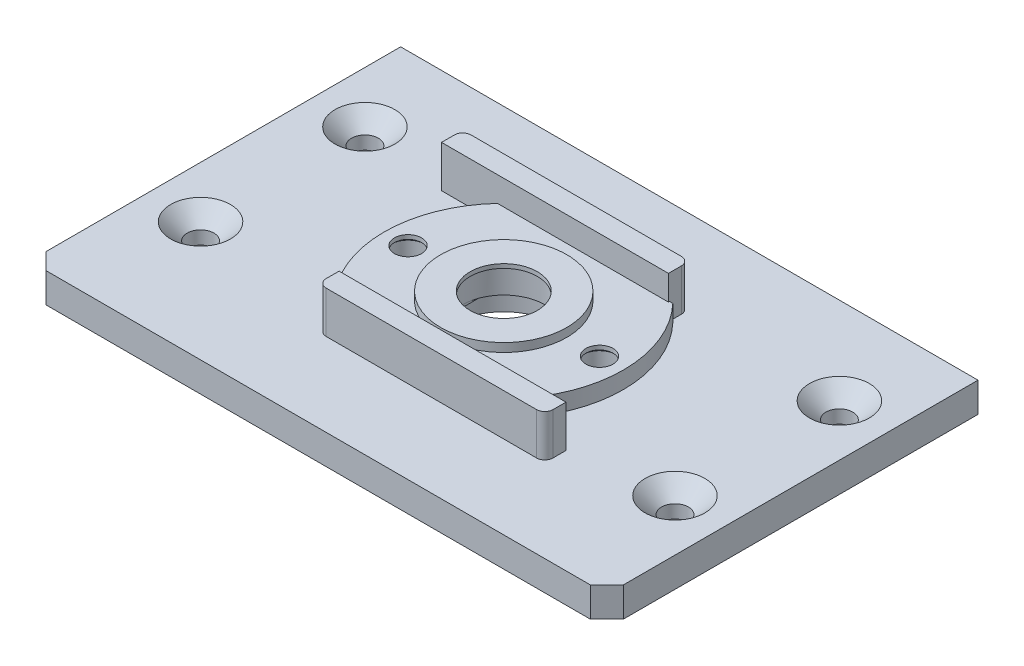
ISO-10303-21;
HEADER;
FILE_DESCRIPTION(('STEP AP214'),'2;1');
FILE_NAME('part.step','',(''),(''),'','','');
FILE_SCHEMA(('AUTOMOTIVE_DESIGN { 1 0 10303 214 1 1 1 1 }'));
ENDSEC;
DATA;
#1=APPLICATION_CONTEXT('core data for automotive mechanical design processes');
#2=APPLICATION_PROTOCOL_DEFINITION('international standard','automotive_design',2000,#1);
#3=PRODUCT_CONTEXT('',#1,'mechanical');
#4=PRODUCT('Part','Part','',(#3));
#5=PRODUCT_RELATED_PRODUCT_CATEGORY('part','',(#4));
#6=PRODUCT_DEFINITION_FORMATION('','',#4);
#7=PRODUCT_DEFINITION_CONTEXT('part definition',#1,'design');
#8=PRODUCT_DEFINITION('design','',#6,#7);
#9=PRODUCT_DEFINITION_SHAPE('','',#8);
#10=(LENGTH_UNIT() NAMED_UNIT(*) SI_UNIT(.MILLI.,.METRE.));
#11=(NAMED_UNIT(*) PLANE_ANGLE_UNIT() SI_UNIT($,.RADIAN.));
#12=(NAMED_UNIT(*) SI_UNIT($,.STERADIAN.) SOLID_ANGLE_UNIT());
#13=UNCERTAINTY_MEASURE_WITH_UNIT(LENGTH_MEASURE(1.E-05),#10,'distance_accuracy_value','');
#14=(GEOMETRIC_REPRESENTATION_CONTEXT(3) GLOBAL_UNCERTAINTY_ASSIGNED_CONTEXT((#13)) GLOBAL_UNIT_ASSIGNED_CONTEXT((#10,
#11,#12)) REPRESENTATION_CONTEXT('',''));
#15=CARTESIAN_POINT('',(0.,0.,0.));
#16=DIRECTION('',(0.,0.,1.));
#17=DIRECTION('',(1.,0.,0.));
#18=AXIS2_PLACEMENT_3D('',#15,#16,#17);
#19=CARTESIAN_POINT('',(0.,-3.6,0.));
#20=DIRECTION('',(0.,1.,0.));
#21=DIRECTION('',(0.,0.,1.));
#22=AXIS2_PLACEMENT_3D('',#19,#20,#21);
#23=CYLINDRICAL_SURFACE('',#22,5.075);
#24=CARTESIAN_POINT('',(0.,2.603,0.));
#25=DIRECTION('',(0.,1.,0.));
#26=DIRECTION('',(0.,0.,1.));
#27=AXIS2_PLACEMENT_3D('',#24,#25,#26);
#28=CIRCLE('',#27,5.075);
#29=CARTESIAN_POINT('',(0.,2.603,5.07499999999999));
#30=VERTEX_POINT('',#29);
#31=EDGE_CURVE('E653',#30,#30,#28,.F.);
#32=ORIENTED_EDGE('',*,*,#31,.F.);
#33=EDGE_LOOP('',(#32));
#34=FACE_BOUND('',#33,.T.);
#35=CARTESIAN_POINT('',(0.,-0.900000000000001,0.));
#36=DIRECTION('',(0.,-1.,0.));
#37=DIRECTION('',(0.,0.,-1.));
#38=AXIS2_PLACEMENT_3D('',#35,#36,#37);
#39=CIRCLE('',#38,5.075);
#40=CARTESIAN_POINT('',(5.07499999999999,-0.900000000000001,0.));
#41=VERTEX_POINT('',#40);
#42=CARTESIAN_POINT('',(-5.07500000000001,-0.900000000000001,0.));
#43=VERTEX_POINT('',#42);
#44=EDGE_CURVE('E324',#41,#43,#39,.T.);
#45=ORIENTED_EDGE('',*,*,#44,.T.);
#46=CARTESIAN_POINT('',(0.,-0.900000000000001,0.));
#47=DIRECTION('',(0.,-1.,0.));
#48=DIRECTION('',(0.,0.,-1.));
#49=AXIS2_PLACEMENT_3D('',#46,#47,#48);
#50=CIRCLE('',#49,5.075);
#51=EDGE_CURVE('E330',#43,#41,#50,.T.);
#52=ORIENTED_EDGE('',*,*,#51,.T.);
#53=EDGE_LOOP('',(#45,#52));
#54=FACE_BOUND('',#53,.T.);
#55=ADVANCED_FACE('F53',(#34,#54),#23,.F.);
#56=CARTESIAN_POINT('',(0.,-1.2,0.));
#57=DIRECTION('',(0.,-1.,0.));
#58=DIRECTION('',(0.,0.,-1.));
#59=AXIS2_PLACEMENT_3D('',#56,#57,#58);
#60=PLANE('',#59);
#61=CARTESIAN_POINT('',(0.,-1.2,0.));
#62=DIRECTION('',(0.,-1.,0.));
#63=DIRECTION('',(0.,0.,-1.));
#64=AXIS2_PLACEMENT_3D('',#61,#62,#63);
#65=CIRCLE('',#64,6.404);
#66=CARTESIAN_POINT('',(5.07499999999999,-1.2000000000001,-3.90584062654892));
#67=VERTEX_POINT('',#66);
#68=CARTESIAN_POINT('',(5.07499999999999,-1.2,3.9058406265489));
#69=VERTEX_POINT('',#68);
#70=EDGE_CURVE('E338',#67,#69,#65,.T.);
#71=ORIENTED_EDGE('',*,*,#70,.T.);
#72=DIRECTION('',(0.,0.,-1.));
#73=VECTOR('',#72,1.);
#74=CARTESIAN_POINT('',(5.07499999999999,-1.2,0.));
#75=LINE('',#74,#73);
#76=EDGE_CURVE('E12',#69,#67,#75,.T.);
#77=ORIENTED_EDGE('',*,*,#76,.T.);
#78=EDGE_LOOP('',(#71,#77));
#79=FACE_BOUND('',#78,.T.);
#80=ADVANCED_FACE('F676',(#79),#60,.T.);
#81=CARTESIAN_POINT('',(-11.608,2.06,0.));
#82=DIRECTION('',(0.,-1.,0.));
#83=DIRECTION('',(0.,0.,-1.));
#84=AXIS2_PLACEMENT_3D('',#81,#82,#83);
#85=CYLINDRICAL_SURFACE('',#84,2.1);
#86=CARTESIAN_POINT('',(-11.608,1.15999999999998,0.));
#87=DIRECTION('',(0.,1.,0.));
#88=DIRECTION('',(0.,0.,1.));
#89=AXIS2_PLACEMENT_3D('',#86,#87,#88);
#90=CIRCLE('',#89,2.1);
#91=CARTESIAN_POINT('',(-11.608,1.15999999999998,2.1));
#92=VERTEX_POINT('',#91);
#93=EDGE_CURVE('E289',#92,#92,#90,.T.);
#94=ORIENTED_EDGE('',*,*,#93,.T.);
#95=EDGE_LOOP('',(#94));
#96=FACE_BOUND('',#95,.T.);
#97=CARTESIAN_POINT('',(-11.608,-3.6,0.));
#98=DIRECTION('',(0.,-1.,0.));
#99=DIRECTION('',(0.,0.,-1.));
#100=AXIS2_PLACEMENT_3D('',#97,#98,#99);
#101=CIRCLE('',#100,2.1);
#102=CARTESIAN_POINT('',(-11.608,-3.6,-2.1));
#103=VERTEX_POINT('',#102);
#104=EDGE_CURVE('E387',#103,#103,#101,.F.);
#105=ORIENTED_EDGE('',*,*,#104,.F.);
#106=EDGE_LOOP('',(#105));
#107=FACE_BOUND('',#106,.T.);
#108=ADVANCED_FACE('F682',(#96,#107),#85,.F.);
#109=CARTESIAN_POINT('',(11.608,2.06,0.));
#110=DIRECTION('',(0.,-1.,0.));
#111=DIRECTION('',(0.,0.,-1.));
#112=AXIS2_PLACEMENT_3D('',#109,#110,#111);
#113=CYLINDRICAL_SURFACE('',#112,2.1);
#114=CARTESIAN_POINT('',(11.608,1.16,0.));
#115=DIRECTION('',(0.,1.,0.));
#116=DIRECTION('',(0.,0.,1.));
#117=AXIS2_PLACEMENT_3D('',#114,#115,#116);
#118=CIRCLE('',#117,2.1);
#119=CARTESIAN_POINT('',(11.608,1.16,2.1));
#120=VERTEX_POINT('',#119);
#121=EDGE_CURVE('E601',#120,#120,#118,.T.);
#122=ORIENTED_EDGE('',*,*,#121,.T.);
#123=EDGE_LOOP('',(#122));
#124=FACE_BOUND('',#123,.T.);
#125=CARTESIAN_POINT('',(11.608,-3.6,0.));
#126=DIRECTION('',(0.,-1.,0.));
#127=DIRECTION('',(0.,0.,-1.));
#128=AXIS2_PLACEMENT_3D('',#125,#126,#127);
#129=CIRCLE('',#128,2.1);
#130=CARTESIAN_POINT('',(11.608,-3.6,-2.1));
#131=VERTEX_POINT('',#130);
#132=EDGE_CURVE('E391',#131,#131,#129,.F.);
#133=ORIENTED_EDGE('',*,*,#132,.F.);
#134=EDGE_LOOP('',(#133));
#135=FACE_BOUND('',#134,.T.);
#136=ADVANCED_FACE('F745',(#124,#135),#113,.F.);
#137=CARTESIAN_POINT('',(0.,-3.6,0.));
#138=DIRECTION('',(0.,1.,0.));
#139=DIRECTION('',(0.,0.,1.));
#140=AXIS2_PLACEMENT_3D('',#137,#138,#139);
#141=CYLINDRICAL_SURFACE('',#140,6.404);
#142=DIRECTION('',(0.,1.,0.));
#143=VECTOR('',#142,1.);
#144=CARTESIAN_POINT('',(5.07499999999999,-3.6000000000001,-3.90584062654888));
#145=LINE('',#144,#143);
#146=CARTESIAN_POINT('',(5.07499999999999,-0.900000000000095,-3.90584062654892));
#147=VERTEX_POINT('',#146);
#148=EDGE_CURVE('E73',#67,#147,#145,.T.);
#149=ORIENTED_EDGE('',*,*,#148,.T.);
#150=CARTESIAN_POINT('',(0.,-0.899999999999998,0.));
#151=DIRECTION('',(0.,-1.,0.));
#152=DIRECTION('',(0.,0.,-1.));
#153=AXIS2_PLACEMENT_3D('',#150,#151,#152);
#154=CIRCLE('',#153,6.404);
#155=CARTESIAN_POINT('',(-5.07500000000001,-0.900000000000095,-3.90584062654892));
#156=VERTEX_POINT('',#155);
#157=EDGE_CURVE('E290',#156,#147,#154,.T.);
#158=ORIENTED_EDGE('',*,*,#157,.F.);
#159=DIRECTION('',(0.,1.,0.));
#160=VECTOR('',#159,1.);
#161=CARTESIAN_POINT('',(-5.07500000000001,-3.6000000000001,-3.90584062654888));
#162=LINE('',#161,#160);
#163=CARTESIAN_POINT('',(-5.07500000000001,-1.2000000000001,-3.90584062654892));
#164=VERTEX_POINT('',#163);
#165=EDGE_CURVE('E83',#164,#156,#162,.T.);
#166=ORIENTED_EDGE('',*,*,#165,.F.);
#167=CARTESIAN_POINT('',(0.,-1.2,0.));
#168=DIRECTION('',(0.,-1.,0.));
#169=DIRECTION('',(0.,0.,-1.));
#170=AXIS2_PLACEMENT_3D('',#167,#168,#169);
#171=CIRCLE('',#170,6.404);
#172=CARTESIAN_POINT('',(-5.07500000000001,-1.2,3.9058406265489));
#173=VERTEX_POINT('',#172);
#174=EDGE_CURVE('E297',#173,#164,#171,.T.);
#175=ORIENTED_EDGE('',*,*,#174,.F.);
#176=DIRECTION('',(0.,1.,0.));
#177=VECTOR('',#176,1.);
#178=CARTESIAN_POINT('',(-5.07500000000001,-3.6,3.9058406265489));
#179=LINE('',#178,#177);
#180=CARTESIAN_POINT('',(-5.07500000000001,-0.900000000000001,3.9058406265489));
#181=VERTEX_POINT('',#180);
#182=EDGE_CURVE('E293',#173,#181,#179,.T.);
#183=ORIENTED_EDGE('',*,*,#182,.T.);
#184=CARTESIAN_POINT('',(5.07499999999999,-0.900000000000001,3.9058406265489));
#185=VERTEX_POINT('',#184);
#186=EDGE_CURVE('E277',#185,#181,#154,.T.);
#187=ORIENTED_EDGE('',*,*,#186,.F.);
#188=DIRECTION('',(0.,1.,0.));
#189=VECTOR('',#188,1.);
#190=CARTESIAN_POINT('',(5.07499999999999,-3.6,3.9058406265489));
#191=LINE('',#190,#189);
#192=EDGE_CURVE('E314',#69,#185,#191,.T.);
#193=ORIENTED_EDGE('',*,*,#192,.F.);
#194=ORIENTED_EDGE('',*,*,#70,.F.);
#195=EDGE_LOOP('',(#149,#158,#166,#175,#183,#187,#193,#194));
#196=FACE_BOUND('',#195,.T.);
#197=CARTESIAN_POINT('',(0.,-3.6,0.));
#198=DIRECTION('',(0.,-1.,0.));
#199=DIRECTION('',(0.,0.,-1.));
#200=AXIS2_PLACEMENT_3D('',#197,#198,#199);
#201=CIRCLE('',#200,6.404);
#202=CARTESIAN_POINT('',(0.,-3.6,-6.40400000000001));
#203=VERTEX_POINT('',#202);
#204=EDGE_CURVE('E383',#203,#203,#201,.T.);
#205=ORIENTED_EDGE('',*,*,#204,.T.);
#206=EDGE_LOOP('',(#205));
#207=FACE_BOUND('',#206,.T.);
#208=ADVANCED_FACE('F294',(#196,#207),#141,.F.);
#209=CARTESIAN_POINT('',(0.,-0.900000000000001,0.));
#210=DIRECTION('',(0.,-1.,0.));
#211=DIRECTION('',(0.,0.,-1.));
#212=AXIS2_PLACEMENT_3D('',#209,#210,#211);
#213=PLANE('',#212);
#214=ORIENTED_EDGE('',*,*,#51,.F.);
#215=DIRECTION('',(0.,0.,1.));
#216=VECTOR('',#215,1.);
#217=CARTESIAN_POINT('',(-5.07500000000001,-0.900000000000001,0.));
#218=LINE('',#217,#216);
#219=EDGE_CURVE('E304',#156,#43,#218,.T.);
#220=ORIENTED_EDGE('',*,*,#219,.F.);
#221=ORIENTED_EDGE('',*,*,#157,.T.);
#222=DIRECTION('',(0.,0.,1.));
#223=VECTOR('',#222,1.);
#224=CARTESIAN_POINT('',(5.07499999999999,-0.900000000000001,0.));
#225=LINE('',#224,#223);
#226=EDGE_CURVE('E310',#147,#41,#225,.T.);
#227=ORIENTED_EDGE('',*,*,#226,.T.);
#228=EDGE_LOOP('',(#214,#220,#221,#227));
#229=FACE_BOUND('',#228,.T.);
#230=ADVANCED_FACE('F1139',(#229),#213,.T.);
#231=ORIENTED_EDGE('',*,*,#44,.F.);
#232=EDGE_CURVE('E285',#41,#185,#225,.T.);
#233=ORIENTED_EDGE('',*,*,#232,.T.);
#234=ORIENTED_EDGE('',*,*,#186,.T.);
#235=EDGE_CURVE('E282',#43,#181,#218,.T.);
#236=ORIENTED_EDGE('',*,*,#235,.F.);
#237=EDGE_LOOP('',(#231,#233,#234,#236));
#238=FACE_BOUND('',#237,.T.);
#239=ADVANCED_FACE('F280',(#238),#213,.T.);
#240=CARTESIAN_POINT('',(0.,2.06,0.));
#241=DIRECTION('',(0.,-1.,0.));
#242=DIRECTION('',(0.,0.,-1.));
#243=AXIS2_PLACEMENT_3D('',#240,#241,#242);
#244=CYLINDRICAL_SURFACE('',#243,14.5);
#245=DIRECTION('',(0.,-1.,0.));
#246=VECTOR('',#245,1.);
#247=CARTESIAN_POINT('',(10.6260079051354,2.06,9.866));
#248=LINE('',#247,#246);
#249=CARTESIAN_POINT('',(10.6260079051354,0.,9.866));
#250=VERTEX_POINT('',#249);
#251=CARTESIAN_POINT('',(10.6260079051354,2.06,9.866));
#252=VERTEX_POINT('',#251);
#253=EDGE_CURVE('E483',#250,#252,#248,.F.);
#254=ORIENTED_EDGE('',*,*,#253,.F.);
#255=CARTESIAN_POINT('',(0.,0.,0.));
#256=DIRECTION('',(0.,1.,0.));
#257=DIRECTION('',(0.,0.,1.));
#258=AXIS2_PLACEMENT_3D('',#255,#256,#257);
#259=CIRCLE('',#258,14.5);
#260=CARTESIAN_POINT('',(10.5,0.,-10.));
#261=VERTEX_POINT('',#260);
#262=EDGE_CURVE('E514',#250,#261,#259,.T.);
#263=ORIENTED_EDGE('',*,*,#262,.T.);
#264=DIRECTION('',(0.,-1.,0.));
#265=VECTOR('',#264,1.);
#266=CARTESIAN_POINT('',(10.5,2.05999999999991,-10.));
#267=LINE('',#266,#265);
#268=CARTESIAN_POINT('',(10.5,2.05999999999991,-10.));
#269=VERTEX_POINT('',#268);
#270=EDGE_CURVE('E523',#269,#261,#267,.T.);
#271=ORIENTED_EDGE('',*,*,#270,.F.);
#272=CARTESIAN_POINT('',(0.,2.06,0.));
#273=DIRECTION('',(0.,1.,0.));
#274=DIRECTION('',(0.,0.,1.));
#275=AXIS2_PLACEMENT_3D('',#272,#273,#274);
#276=CIRCLE('',#275,14.5);
#277=EDGE_CURVE('E503',#252,#269,#276,.T.);
#278=ORIENTED_EDGE('',*,*,#277,.F.);
#279=EDGE_LOOP('',(#254,#263,#271,#278));
#280=FACE_BOUND('',#279,.T.);
#281=ADVANCED_FACE('F723',(#280),#244,.T.);
#282=DIRECTION('',(0.,-1.,0.));
#283=VECTOR('',#282,1.);
#284=CARTESIAN_POINT('',(-10.6260079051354,2.05999999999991,-9.866));
#285=LINE('',#284,#283);
#286=CARTESIAN_POINT('',(-10.6260079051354,0.,-9.866));
#287=VERTEX_POINT('',#286);
#288=CARTESIAN_POINT('',(-10.6260079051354,2.05999999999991,-9.866));
#289=VERTEX_POINT('',#288);
#290=EDGE_CURVE('E490',#287,#289,#285,.F.);
#291=ORIENTED_EDGE('',*,*,#290,.F.);
#292=CARTESIAN_POINT('',(-10.5,0.,10.));
#293=VERTEX_POINT('',#292);
#294=EDGE_CURVE('E500',#287,#293,#259,.T.);
#295=ORIENTED_EDGE('',*,*,#294,.T.);
#296=DIRECTION('',(0.,-1.,0.));
#297=VECTOR('',#296,1.);
#298=CARTESIAN_POINT('',(-10.5,2.06,10.));
#299=LINE('',#298,#297);
#300=CARTESIAN_POINT('',(-10.5,2.06,10.));
#301=VERTEX_POINT('',#300);
#302=EDGE_CURVE('E507',#301,#293,#299,.T.);
#303=ORIENTED_EDGE('',*,*,#302,.F.);
#304=EDGE_CURVE('E504',#289,#301,#276,.T.);
#305=ORIENTED_EDGE('',*,*,#304,.F.);
#306=EDGE_LOOP('',(#291,#295,#303,#305));
#307=FACE_BOUND('',#306,.T.);
#308=ADVANCED_FACE('F711',(#307),#244,.T.);
#309=CARTESIAN_POINT('',(0.,2.06,0.));
#310=DIRECTION('',(0.,1.,0.));
#311=DIRECTION('',(0.,0.,1.));
#312=AXIS2_PLACEMENT_3D('',#309,#310,#311);
#313=PLANE('',#312);
#314=CARTESIAN_POINT('',(0.,2.06,0.));
#315=DIRECTION('',(0.,1.,0.));
#316=DIRECTION('',(0.,0.,1.));
#317=AXIS2_PLACEMENT_3D('',#314,#315,#316);
#318=CIRCLE('',#317,7.65);
#319=CARTESIAN_POINT('',(0.,2.06,7.64999999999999));
#320=VERTEX_POINT('',#319);
#321=EDGE_CURVE('E495',#320,#320,#318,.T.);
#322=ORIENTED_EDGE('',*,*,#321,.F.);
#323=EDGE_LOOP('',(#322));
#324=FACE_BOUND('',#323,.T.);
#325=DIRECTION('',(0.,0.,-1.));
#326=VECTOR('',#325,1.);
#327=CARTESIAN_POINT('',(10.099911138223,2.06,0.));
#328=LINE('',#327,#326);
#329=CARTESIAN_POINT('',(10.099911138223,2.05999999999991,-9.866));
#330=VERTEX_POINT('',#329);
#331=CARTESIAN_POINT('',(10.099911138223,2.05999999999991,-10.));
#332=VERTEX_POINT('',#331);
#333=EDGE_CURVE('E538',#330,#332,#328,.T.);
#334=ORIENTED_EDGE('',*,*,#333,.F.);
#335=DIRECTION('',(-1.,0.,0.));
#336=VECTOR('',#335,1.);
#337=CARTESIAN_POINT('',(0.,2.05999999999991,-9.866));
#338=LINE('',#337,#336);
#339=EDGE_CURVE('E542',#330,#289,#338,.T.);
#340=ORIENTED_EDGE('',*,*,#339,.T.);
#341=ORIENTED_EDGE('',*,*,#304,.T.);
#342=DIRECTION('',(1.,0.,0.));
#343=VECTOR('',#342,1.);
#344=CARTESIAN_POINT('',(0.,2.06,10.));
#345=LINE('',#344,#343);
#346=CARTESIAN_POINT('',(-10.099911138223,2.06,10.));
#347=VERTEX_POINT('',#346);
#348=EDGE_CURVE('E499',#301,#347,#345,.T.);
#349=ORIENTED_EDGE('',*,*,#348,.T.);
#350=DIRECTION('',(0.,0.,1.));
#351=VECTOR('',#350,1.);
#352=CARTESIAN_POINT('',(-10.099911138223,2.06,0.));
#353=LINE('',#352,#351);
#354=CARTESIAN_POINT('',(-10.099911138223,2.06,9.86599999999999));
#355=VERTEX_POINT('',#354);
#356=EDGE_CURVE('E531',#355,#347,#353,.T.);
#357=ORIENTED_EDGE('',*,*,#356,.F.);
#358=DIRECTION('',(1.,0.,0.));
#359=VECTOR('',#358,1.);
#360=CARTESIAN_POINT('',(0.,2.06,9.866));
#361=LINE('',#360,#359);
#362=EDGE_CURVE('E535',#355,#252,#361,.T.);
#363=ORIENTED_EDGE('',*,*,#362,.T.);
#364=ORIENTED_EDGE('',*,*,#277,.T.);
#365=DIRECTION('',(1.,0.,0.));
#366=VECTOR('',#365,1.);
#367=CARTESIAN_POINT('',(0.,2.05999999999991,-10.));
#368=LINE('',#367,#366);
#369=EDGE_CURVE('E508',#332,#269,#368,.T.);
#370=ORIENTED_EDGE('',*,*,#369,.F.);
#371=EDGE_LOOP('',(#334,#340,#341,#349,#357,#363,#364,#370));
#372=FACE_BOUND('',#371,.T.);
#373=CARTESIAN_POINT('',(11.608,2.06,0.));
#374=DIRECTION('',(0.,1.,0.));
#375=DIRECTION('',(0.,0.,1.));
#376=AXIS2_PLACEMENT_3D('',#373,#374,#375);
#377=CIRCLE('',#376,1.65);
#378=CARTESIAN_POINT('',(11.608,2.06,1.65));
#379=VERTEX_POINT('',#378);
#380=EDGE_CURVE('E343',#379,#379,#377,.T.);
#381=ORIENTED_EDGE('',*,*,#380,.F.);
#382=EDGE_LOOP('',(#381));
#383=FACE_BOUND('',#382,.T.);
#384=CARTESIAN_POINT('',(-11.608,2.06,0.));
#385=DIRECTION('',(0.,1.,0.));
#386=DIRECTION('',(0.,0.,1.));
#387=AXIS2_PLACEMENT_3D('',#384,#385,#386);
#388=CIRCLE('',#387,1.65);
#389=CARTESIAN_POINT('',(-11.608,2.06,1.65));
#390=VERTEX_POINT('',#389);
#391=EDGE_CURVE('E339',#390,#390,#388,.T.);
#392=ORIENTED_EDGE('',*,*,#391,.F.);
#393=EDGE_LOOP('',(#392));
#394=FACE_BOUND('',#393,.T.);
#395=ADVANCED_FACE('F707',(#324,#372,#383,#394),#313,.T.);
#396=CARTESIAN_POINT('',(0.,3.103,0.));
#397=DIRECTION('',(0.,-1.,0.));
#398=DIRECTION('',(0.,0.,-1.));
#399=AXIS2_PLACEMENT_3D('',#396,#397,#398);
#400=CYLINDRICAL_SURFACE('',#399,7.65);
#401=ORIENTED_EDGE('',*,*,#321,.T.);
#402=EDGE_LOOP('',(#401));
#403=FACE_BOUND('',#402,.T.);
#404=CARTESIAN_POINT('',(0.,3.103,0.));
#405=DIRECTION('',(0.,1.,0.));
#406=DIRECTION('',(0.,0.,1.));
#407=AXIS2_PLACEMENT_3D('',#404,#405,#406);
#408=CIRCLE('',#407,7.65);
#409=CARTESIAN_POINT('',(0.,3.103,7.64999999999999));
#410=VERTEX_POINT('',#409);
#411=EDGE_CURVE('E527',#410,#410,#408,.T.);
#412=ORIENTED_EDGE('',*,*,#411,.F.);
#413=EDGE_LOOP('',(#412));
#414=FACE_BOUND('',#413,.T.);
#415=ADVANCED_FACE('F710',(#403,#414),#400,.T.);
#416=CARTESIAN_POINT('',(0.,3.103,0.));
#417=DIRECTION('',(0.,1.,0.));
#418=DIRECTION('',(0.,0.,1.));
#419=AXIS2_PLACEMENT_3D('',#416,#417,#418);
#420=PLANE('',#419);
#421=ORIENTED_EDGE('',*,*,#411,.T.);
#422=EDGE_LOOP('',(#421));
#423=FACE_BOUND('',#422,.T.);
#424=CARTESIAN_POINT('',(0.,3.103,0.));
#425=DIRECTION('',(0.,1.,0.));
#426=DIRECTION('',(0.,0.,1.));
#427=AXIS2_PLACEMENT_3D('',#424,#425,#426);
#428=CIRCLE('',#427,4.075);
#429=CARTESIAN_POINT('',(0.,3.103,4.07499999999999));
#430=VERTEX_POINT('',#429);
#431=EDGE_CURVE('E300',#430,#430,#428,.T.);
#432=ORIENTED_EDGE('',*,*,#431,.F.);
#433=EDGE_LOOP('',(#432));
#434=FACE_BOUND('',#433,.T.);
#435=ADVANCED_FACE('F719',(#423,#434),#420,.T.);
#436=CARTESIAN_POINT('',(0.,2.06,10.));
#437=DIRECTION('',(0.,0.,-1.));
#438=DIRECTION('',(-1.,0.,0.));
#439=AXIS2_PLACEMENT_3D('',#436,#437,#438);
#440=PLANE('',#439);
#441=DIRECTION('',(1.,0.,0.));
#442=VECTOR('',#441,1.);
#443=CARTESIAN_POINT('',(0.,0.,10.));
#444=LINE('',#443,#442);
#445=CARTESIAN_POINT('',(-10.099911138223,0.,10.));
#446=VERTEX_POINT('',#445);
#447=EDGE_CURVE('E494',#293,#446,#444,.T.);
#448=ORIENTED_EDGE('',*,*,#447,.T.);
#449=DIRECTION('',(0.,1.,0.));
#450=VECTOR('',#449,1.);
#451=CARTESIAN_POINT('',(-10.099911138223,2.06,10.));
#452=LINE('',#451,#450);
#453=EDGE_CURVE('E448',#446,#347,#452,.T.);
#454=ORIENTED_EDGE('',*,*,#453,.T.);
#455=ORIENTED_EDGE('',*,*,#348,.F.);
#456=ORIENTED_EDGE('',*,*,#302,.T.);
#457=EDGE_LOOP('',(#448,#454,#455,#456));
#458=FACE_BOUND('',#457,.T.);
#459=ADVANCED_FACE('F738',(#458),#440,.F.);
#460=CARTESIAN_POINT('',(0.,2.05999999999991,-10.));
#461=DIRECTION('',(0.,0.,-1.));
#462=DIRECTION('',(-1.,0.,0.));
#463=AXIS2_PLACEMENT_3D('',#460,#461,#462);
#464=PLANE('',#463);
#465=DIRECTION('',(0.,-1.,0.));
#466=VECTOR('',#465,1.);
#467=CARTESIAN_POINT('',(10.099911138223,2.05999999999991,-10.));
#468=LINE('',#467,#466);
#469=CARTESIAN_POINT('',(10.099911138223,0.,-10.));
#470=VERTEX_POINT('',#469);
#471=EDGE_CURVE('E486',#332,#470,#468,.T.);
#472=ORIENTED_EDGE('',*,*,#471,.F.);
#473=ORIENTED_EDGE('',*,*,#369,.T.);
#474=ORIENTED_EDGE('',*,*,#270,.T.);
#475=DIRECTION('',(1.,0.,0.));
#476=VECTOR('',#475,1.);
#477=CARTESIAN_POINT('',(0.,0.,-10.));
#478=LINE('',#477,#476);
#479=EDGE_CURVE('E518',#470,#261,#478,.T.);
#480=ORIENTED_EDGE('',*,*,#479,.F.);
#481=EDGE_LOOP('',(#472,#473,#474,#480));
#482=FACE_BOUND('',#481,.T.);
#483=ADVANCED_FACE('F734',(#482),#464,.T.);
#484=CARTESIAN_POINT('',(17.409088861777,5.08,9.866));
#485=DIRECTION('',(0.,0.,1.));
#486=DIRECTION('',(1.,0.,0.));
#487=AXIS2_PLACEMENT_3D('',#484,#485,#486);
#488=PLANE('',#487);
#489=DIRECTION('',(-1.,0.,0.));
#490=VECTOR('',#489,1.);
#491=CARTESIAN_POINT('',(17.409088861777,0.,9.866));
#492=LINE('',#491,#490);
#493=CARTESIAN_POINT('',(17.409088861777,0.,9.866));
#494=VERTEX_POINT('',#493);
#495=EDGE_CURVE('E458',#494,#250,#492,.T.);
#496=ORIENTED_EDGE('',*,*,#495,.T.);
#497=ORIENTED_EDGE('',*,*,#253,.T.);
#498=ORIENTED_EDGE('',*,*,#362,.F.);
#499=DIRECTION('',(0.,-1.,0.));
#500=VECTOR('',#499,1.);
#501=CARTESIAN_POINT('',(-10.099911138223,5.08,9.86599999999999));
#502=LINE('',#501,#500);
#503=CARTESIAN_POINT('',(-10.099911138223,5.08,9.86599999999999));
#504=VERTEX_POINT('',#503);
#505=EDGE_CURVE('E449',#504,#355,#502,.T.);
#506=ORIENTED_EDGE('',*,*,#505,.F.);
#507=DIRECTION('',(-1.,0.,0.));
#508=VECTOR('',#507,1.);
#509=CARTESIAN_POINT('',(17.409088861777,5.08,9.866));
#510=LINE('',#509,#508);
#511=CARTESIAN_POINT('',(17.409088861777,5.08,9.866));
#512=VERTEX_POINT('',#511);
#513=EDGE_CURVE('E470',#512,#504,#510,.T.);
#514=ORIENTED_EDGE('',*,*,#513,.F.);
#515=DIRECTION('',(0.,-1.,0.));
#516=VECTOR('',#515,1.);
#517=CARTESIAN_POINT('',(17.409088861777,5.08,9.866));
#518=LINE('',#517,#516);
#519=EDGE_CURVE('E412',#512,#494,#518,.T.);
#520=ORIENTED_EDGE('',*,*,#519,.T.);
#521=EDGE_LOOP('',(#496,#497,#498,#506,#514,#520));
#522=FACE_BOUND('',#521,.T.);
#523=ADVANCED_FACE('F737',(#522),#488,.F.);
#524=CARTESIAN_POINT('',(-10.099911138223,5.07999999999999,12.432));
#525=DIRECTION('',(-1.,0.,0.));
#526=DIRECTION('',(0.,0.,1.));
#527=AXIS2_PLACEMENT_3D('',#524,#525,#526);
#528=PLANE('',#527);
#529=DIRECTION('',(0.,0.,-1.));
#530=VECTOR('',#529,1.);
#531=CARTESIAN_POINT('',(-10.099911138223,0.,12.432));
#532=LINE('',#531,#530);
#533=CARTESIAN_POINT('',(-10.099911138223,0.,11.432));
#534=VERTEX_POINT('',#533);
#535=EDGE_CURVE('E463',#534,#446,#532,.T.);
#536=ORIENTED_EDGE('',*,*,#535,.F.);
#537=DIRECTION('',(0.,-1.,0.));
#538=VECTOR('',#537,1.);
#539=CARTESIAN_POINT('',(-10.099911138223,5.07999999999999,11.432));
#540=LINE('',#539,#538);
#541=CARTESIAN_POINT('',(-10.099911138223,5.07999999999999,11.432));
#542=VERTEX_POINT('',#541);
#543=EDGE_CURVE('E581',#534,#542,#540,.F.);
#544=ORIENTED_EDGE('',*,*,#543,.T.);
#545=DIRECTION('',(0.,0.,-1.));
#546=VECTOR('',#545,1.);
#547=CARTESIAN_POINT('',(-10.099911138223,5.07999999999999,12.432));
#548=LINE('',#547,#546);
#549=EDGE_CURVE('E474',#542,#504,#548,.T.);
#550=ORIENTED_EDGE('',*,*,#549,.T.);
#551=ORIENTED_EDGE('',*,*,#505,.T.);
#552=ORIENTED_EDGE('',*,*,#356,.T.);
#553=ORIENTED_EDGE('',*,*,#453,.F.);
#554=EDGE_LOOP('',(#536,#544,#550,#551,#552,#553));
#555=FACE_BOUND('',#554,.T.);
#556=ADVANCED_FACE('F904',(#555),#528,.T.);
#557=CARTESIAN_POINT('',(17.409088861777,5.07999999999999,12.432));
#558=DIRECTION('',(0.,0.,1.));
#559=DIRECTION('',(1.,0.,0.));
#560=AXIS2_PLACEMENT_3D('',#557,#558,#559);
#561=PLANE('',#560);
#562=DIRECTION('',(-1.,0.,0.));
#563=VECTOR('',#562,1.);
#564=CARTESIAN_POINT('',(17.409088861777,0.,12.432));
#565=LINE('',#564,#563);
#566=CARTESIAN_POINT('',(16.409088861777,0.,12.432));
#567=VERTEX_POINT('',#566);
#568=CARTESIAN_POINT('',(-9.09991113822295,0.,12.432));
#569=VERTEX_POINT('',#568);
#570=EDGE_CURVE('E432',#567,#569,#565,.T.);
#571=ORIENTED_EDGE('',*,*,#570,.F.);
#572=DIRECTION('',(0.,-1.,0.));
#573=VECTOR('',#572,1.);
#574=CARTESIAN_POINT('',(16.409088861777,5.07999999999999,12.432));
#575=LINE('',#574,#573);
#576=CARTESIAN_POINT('',(16.409088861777,5.07999999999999,12.432));
#577=VERTEX_POINT('',#576);
#578=EDGE_CURVE('E572',#567,#577,#575,.F.);
#579=ORIENTED_EDGE('',*,*,#578,.T.);
#580=DIRECTION('',(-1.,0.,0.));
#581=VECTOR('',#580,1.);
#582=CARTESIAN_POINT('',(17.409088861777,5.07999999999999,12.432));
#583=LINE('',#582,#581);
#584=CARTESIAN_POINT('',(-9.09991113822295,5.07999999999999,12.432));
#585=VERTEX_POINT('',#584);
#586=EDGE_CURVE('E459',#577,#585,#583,.T.);
#587=ORIENTED_EDGE('',*,*,#586,.T.);
#588=DIRECTION('',(0.,-1.,0.));
#589=VECTOR('',#588,1.);
#590=CARTESIAN_POINT('',(-9.09991113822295,5.07999999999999,12.432));
#591=LINE('',#590,#589);
#592=EDGE_CURVE('E568',#585,#569,#591,.T.);
#593=ORIENTED_EDGE('',*,*,#592,.T.);
#594=EDGE_LOOP('',(#571,#579,#587,#593));
#595=FACE_BOUND('',#594,.T.);
#596=ADVANCED_FACE('F900',(#595),#561,.T.);
#597=CARTESIAN_POINT('',(17.409088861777,5.07999999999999,12.432));
#598=DIRECTION('',(-1.,0.,0.));
#599=DIRECTION('',(0.,0.,1.));
#600=AXIS2_PLACEMENT_3D('',#597,#598,#599);
#601=PLANE('',#600);
#602=DIRECTION('',(0.,0.,-1.));
#603=VECTOR('',#602,1.);
#604=CARTESIAN_POINT('',(17.409088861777,5.07999999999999,12.432));
#605=LINE('',#604,#603);
#606=CARTESIAN_POINT('',(17.409088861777,5.07999999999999,11.432));
#607=VERTEX_POINT('',#606);
#608=EDGE_CURVE('E453',#607,#512,#605,.T.);
#609=ORIENTED_EDGE('',*,*,#608,.F.);
#610=DIRECTION('',(0.,-1.,0.));
#611=VECTOR('',#610,1.);
#612=CARTESIAN_POINT('',(17.409088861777,0.,11.432));
#613=LINE('',#612,#611);
#614=CARTESIAN_POINT('',(17.409088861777,0.,11.432));
#615=VERTEX_POINT('',#614);
#616=EDGE_CURVE('E565',#607,#615,#613,.T.);
#617=ORIENTED_EDGE('',*,*,#616,.T.);
#618=DIRECTION('',(0.,0.,-1.));
#619=VECTOR('',#618,1.);
#620=CARTESIAN_POINT('',(17.409088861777,0.,12.432));
#621=LINE('',#620,#619);
#622=EDGE_CURVE('E456',#615,#494,#621,.T.);
#623=ORIENTED_EDGE('',*,*,#622,.T.);
#624=ORIENTED_EDGE('',*,*,#519,.F.);
#625=EDGE_LOOP('',(#609,#617,#623,#624));
#626=FACE_BOUND('',#625,.T.);
#627=ADVANCED_FACE('F903',(#626),#601,.F.);
#628=CARTESIAN_POINT('',(0.,5.08,0.));
#629=DIRECTION('',(0.,-1.,0.));
#630=DIRECTION('',(0.,0.,-1.));
#631=AXIS2_PLACEMENT_3D('',#628,#629,#630);
#632=PLANE('',#631);
#633=ORIENTED_EDGE('',*,*,#586,.F.);
#634=CARTESIAN_POINT('',(16.409088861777,5.07999999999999,11.432));
#635=DIRECTION('',(0.,-1.,0.));
#636=DIRECTION('',(0.,0.,-1.));
#637=AXIS2_PLACEMENT_3D('',#634,#635,#636);
#638=CIRCLE('',#637,1.);
#639=EDGE_CURVE('E578',#577,#607,#638,.F.);
#640=ORIENTED_EDGE('',*,*,#639,.T.);
#641=ORIENTED_EDGE('',*,*,#608,.T.);
#642=ORIENTED_EDGE('',*,*,#513,.T.);
#643=ORIENTED_EDGE('',*,*,#549,.F.);
#644=CARTESIAN_POINT('',(-9.09991113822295,5.07999999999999,11.432));
#645=DIRECTION('',(0.,-1.,0.));
#646=DIRECTION('',(0.,0.,-1.));
#647=AXIS2_PLACEMENT_3D('',#644,#645,#646);
#648=CIRCLE('',#647,1.);
#649=EDGE_CURVE('E575',#542,#585,#648,.F.);
#650=ORIENTED_EDGE('',*,*,#649,.T.);
#651=EDGE_LOOP('',(#633,#640,#641,#642,#643,#650));
#652=FACE_BOUND('',#651,.T.);
#653=ADVANCED_FACE('F729',(#652),#632,.F.);
#654=CARTESIAN_POINT('',(-17.4090888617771,5.0799999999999,-9.866));
#655=DIRECTION('',(0.,0.,-1.));
#656=DIRECTION('',(-1.,0.,0.));
#657=AXIS2_PLACEMENT_3D('',#654,#655,#656);
#658=PLANE('',#657);
#659=DIRECTION('',(1.,0.,0.));
#660=VECTOR('',#659,1.);
#661=CARTESIAN_POINT('',(-17.4090888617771,0.,-9.866));
#662=LINE('',#661,#660);
#663=CARTESIAN_POINT('',(-17.4090888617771,0.,-9.866));
#664=VERTEX_POINT('',#663);
#665=EDGE_CURVE('E431',#664,#287,#662,.T.);
#666=ORIENTED_EDGE('',*,*,#665,.T.);
#667=ORIENTED_EDGE('',*,*,#290,.T.);
#668=ORIENTED_EDGE('',*,*,#339,.F.);
#669=DIRECTION('',(0.,-1.,0.));
#670=VECTOR('',#669,1.);
#671=CARTESIAN_POINT('',(10.099911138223,5.0799999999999,-9.866));
#672=LINE('',#671,#670);
#673=CARTESIAN_POINT('',(10.099911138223,5.0799999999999,-9.866));
#674=VERTEX_POINT('',#673);
#675=EDGE_CURVE('E428',#674,#330,#672,.T.);
#676=ORIENTED_EDGE('',*,*,#675,.F.);
#677=DIRECTION('',(1.,0.,0.));
#678=VECTOR('',#677,1.);
#679=CARTESIAN_POINT('',(-17.4090888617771,5.0799999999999,-9.866));
#680=LINE('',#679,#678);
#681=CARTESIAN_POINT('',(-17.4090888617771,5.0799999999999,-9.866));
#682=VERTEX_POINT('',#681);
#683=EDGE_CURVE('E416',#682,#674,#680,.T.);
#684=ORIENTED_EDGE('',*,*,#683,.F.);
#685=DIRECTION('',(0.,-1.,0.));
#686=VECTOR('',#685,1.);
#687=CARTESIAN_POINT('',(-17.4090888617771,5.0799999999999,-9.866));
#688=LINE('',#687,#686);
#689=EDGE_CURVE('E444',#682,#664,#688,.T.);
#690=ORIENTED_EDGE('',*,*,#689,.T.);
#691=EDGE_LOOP('',(#666,#667,#668,#676,#684,#690));
#692=FACE_BOUND('',#691,.T.);
#693=ADVANCED_FACE('F893',(#692),#658,.F.);
#694=CARTESIAN_POINT('',(-17.409088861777,5.08,-12.432));
#695=DIRECTION('',(1.,0.,0.));
#696=DIRECTION('',(0.,0.,-1.));
#697=AXIS2_PLACEMENT_3D('',#694,#695,#696);
#698=PLANE('',#697);
#699=DIRECTION('',(0.,0.,1.));
#700=VECTOR('',#699,1.);
#701=CARTESIAN_POINT('',(-17.409088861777,5.08,-12.432));
#702=LINE('',#701,#700);
#703=CARTESIAN_POINT('',(-17.409088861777,5.08,-11.432));
#704=VERTEX_POINT('',#703);
#705=EDGE_CURVE('E413',#704,#682,#702,.T.);
#706=ORIENTED_EDGE('',*,*,#705,.F.);
#707=DIRECTION('',(0.,-1.,0.));
#708=VECTOR('',#707,1.);
#709=CARTESIAN_POINT('',(-17.409088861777,0.,-11.432));
#710=LINE('',#709,#708);
#711=CARTESIAN_POINT('',(-17.409088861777,0.,-11.432));
#712=VERTEX_POINT('',#711);
#713=EDGE_CURVE('E545',#704,#712,#710,.T.);
#714=ORIENTED_EDGE('',*,*,#713,.T.);
#715=DIRECTION('',(0.,0.,1.));
#716=VECTOR('',#715,1.);
#717=CARTESIAN_POINT('',(-17.409088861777,0.,-12.432));
#718=LINE('',#717,#716);
#719=EDGE_CURVE('E429',#712,#664,#718,.T.);
#720=ORIENTED_EDGE('',*,*,#719,.T.);
#721=ORIENTED_EDGE('',*,*,#689,.F.);
#722=EDGE_LOOP('',(#706,#714,#720,#721));
#723=FACE_BOUND('',#722,.T.);
#724=ADVANCED_FACE('F891',(#723),#698,.F.);
#725=CARTESIAN_POINT('',(10.099911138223,5.08,-12.432));
#726=DIRECTION('',(1.,0.,0.));
#727=DIRECTION('',(0.,0.,-1.));
#728=AXIS2_PLACEMENT_3D('',#725,#726,#727);
#729=PLANE('',#728);
#730=DIRECTION('',(0.,0.,1.));
#731=VECTOR('',#730,1.);
#732=CARTESIAN_POINT('',(10.099911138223,0.,-12.432));
#733=LINE('',#732,#731);
#734=CARTESIAN_POINT('',(10.099911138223,0.,-11.432));
#735=VERTEX_POINT('',#734);
#736=EDGE_CURVE('E436',#735,#470,#733,.T.);
#737=ORIENTED_EDGE('',*,*,#736,.F.);
#738=DIRECTION('',(0.,-1.,0.));
#739=VECTOR('',#738,1.);
#740=CARTESIAN_POINT('',(10.099911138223,5.08,-11.432));
#741=LINE('',#740,#739);
#742=CARTESIAN_POINT('',(10.099911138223,5.08,-11.432));
#743=VERTEX_POINT('',#742);
#744=EDGE_CURVE('E562',#735,#743,#741,.F.);
#745=ORIENTED_EDGE('',*,*,#744,.T.);
#746=DIRECTION('',(0.,0.,1.));
#747=VECTOR('',#746,1.);
#748=CARTESIAN_POINT('',(10.099911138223,5.08,-12.432));
#749=LINE('',#748,#747);
#750=EDGE_CURVE('E421',#743,#674,#749,.T.);
#751=ORIENTED_EDGE('',*,*,#750,.T.);
#752=ORIENTED_EDGE('',*,*,#675,.T.);
#753=ORIENTED_EDGE('',*,*,#333,.T.);
#754=ORIENTED_EDGE('',*,*,#471,.T.);
#755=EDGE_LOOP('',(#737,#745,#751,#752,#753,#754));
#756=FACE_BOUND('',#755,.T.);
#757=ADVANCED_FACE('F887',(#756),#729,.T.);
#758=CARTESIAN_POINT('',(-17.409088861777,5.08,-12.432));
#759=DIRECTION('',(0.,0.,-1.));
#760=DIRECTION('',(-1.,0.,0.));
#761=AXIS2_PLACEMENT_3D('',#758,#759,#760);
#762=PLANE('',#761);
#763=DIRECTION('',(1.,0.,0.));
#764=VECTOR('',#763,1.);
#765=CARTESIAN_POINT('',(-17.409088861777,0.,-12.432));
#766=LINE('',#765,#764);
#767=CARTESIAN_POINT('',(-16.409088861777,0.,-12.432));
#768=VERTEX_POINT('',#767);
#769=CARTESIAN_POINT('',(9.09991113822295,0.,-12.432));
#770=VERTEX_POINT('',#769);
#771=EDGE_CURVE('E417',#768,#770,#766,.T.);
#772=ORIENTED_EDGE('',*,*,#771,.F.);
#773=DIRECTION('',(0.,-1.,0.));
#774=VECTOR('',#773,1.);
#775=CARTESIAN_POINT('',(-16.409088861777,5.08,-12.432));
#776=LINE('',#775,#774);
#777=CARTESIAN_POINT('',(-16.409088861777,5.08,-12.432));
#778=VERTEX_POINT('',#777);
#779=EDGE_CURVE('E553',#768,#778,#776,.F.);
#780=ORIENTED_EDGE('',*,*,#779,.T.);
#781=DIRECTION('',(1.,0.,0.));
#782=VECTOR('',#781,1.);
#783=CARTESIAN_POINT('',(-17.409088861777,5.08,-12.432));
#784=LINE('',#783,#782);
#785=CARTESIAN_POINT('',(9.09991113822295,5.08,-12.432));
#786=VERTEX_POINT('',#785);
#787=EDGE_CURVE('E424',#778,#786,#784,.T.);
#788=ORIENTED_EDGE('',*,*,#787,.T.);
#789=DIRECTION('',(0.,-1.,0.));
#790=VECTOR('',#789,1.);
#791=CARTESIAN_POINT('',(9.09991113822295,5.08,-12.432));
#792=LINE('',#791,#790);
#793=EDGE_CURVE('E549',#786,#770,#792,.T.);
#794=ORIENTED_EDGE('',*,*,#793,.T.);
#795=EDGE_LOOP('',(#772,#780,#788,#794));
#796=FACE_BOUND('',#795,.T.);
#797=ADVANCED_FACE('F883',(#796),#762,.T.);
#798=CARTESIAN_POINT('',(0.,5.08,0.));
#799=DIRECTION('',(0.,1.,0.));
#800=DIRECTION('',(0.,0.,1.));
#801=AXIS2_PLACEMENT_3D('',#798,#799,#800);
#802=PLANE('',#801);
#803=ORIENTED_EDGE('',*,*,#787,.F.);
#804=CARTESIAN_POINT('',(-16.409088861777,5.08,-11.432));
#805=DIRECTION('',(0.,1.,0.));
#806=DIRECTION('',(0.,0.,1.));
#807=AXIS2_PLACEMENT_3D('',#804,#805,#806);
#808=CIRCLE('',#807,1.);
#809=EDGE_CURVE('E559',#778,#704,#808,.T.);
#810=ORIENTED_EDGE('',*,*,#809,.T.);
#811=ORIENTED_EDGE('',*,*,#705,.T.);
#812=ORIENTED_EDGE('',*,*,#683,.T.);
#813=ORIENTED_EDGE('',*,*,#750,.F.);
#814=CARTESIAN_POINT('',(9.09991113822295,5.08,-11.432));
#815=DIRECTION('',(0.,1.,0.));
#816=DIRECTION('',(0.,0.,1.));
#817=AXIS2_PLACEMENT_3D('',#814,#815,#816);
#818=CIRCLE('',#817,1.);
#819=EDGE_CURVE('E556',#743,#786,#818,.T.);
#820=ORIENTED_EDGE('',*,*,#819,.T.);
#821=EDGE_LOOP('',(#803,#810,#811,#812,#813,#820));
#822=FACE_BOUND('',#821,.T.);
#823=ADVANCED_FACE('F862',(#822),#802,.T.);
#824=CARTESIAN_POINT('',(-35.,-0.400000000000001,0.));
#825=DIRECTION('',(-1.,0.,0.));
#826=DIRECTION('',(0.,0.,1.));
#827=AXIS2_PLACEMENT_3D('',#824,#825,#826);
#828=PLANE('',#827);
#829=DIRECTION('',(0.,0.,1.));
#830=VECTOR('',#829,1.);
#831=CARTESIAN_POINT('',(-35.,-3.6,0.));
#832=LINE('',#831,#830);
#833=CARTESIAN_POINT('',(-35.,-3.6,-22.5));
#834=VERTEX_POINT('',#833);
#835=CARTESIAN_POINT('',(-35.,-3.6000000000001,20.5));
#836=VERTEX_POINT('',#835);
#837=EDGE_CURVE('E368',#834,#836,#832,.T.);
#838=ORIENTED_EDGE('',*,*,#837,.T.);
#839=DIRECTION('',(0.,1.,0.));
#840=VECTOR('',#839,1.);
#841=CARTESIAN_POINT('',(-35.,0.,20.5));
#842=LINE('',#841,#840);
#843=CARTESIAN_POINT('',(-35.,0.,20.5));
#844=VERTEX_POINT('',#843);
#845=EDGE_CURVE('E609',#836,#844,#842,.T.);
#846=ORIENTED_EDGE('',*,*,#845,.T.);
#847=DIRECTION('',(0.,0.,1.));
#848=VECTOR('',#847,1.);
#849=CARTESIAN_POINT('',(-35.,0.,0.));
#850=LINE('',#849,#848);
#851=CARTESIAN_POINT('',(-35.,0.,-22.5));
#852=VERTEX_POINT('',#851);
#853=EDGE_CURVE('E394',#852,#844,#850,.T.);
#854=ORIENTED_EDGE('',*,*,#853,.F.);
#855=DIRECTION('',(0.,1.,0.));
#856=VECTOR('',#855,1.);
#857=CARTESIAN_POINT('',(-35.,-0.400000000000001,-22.5));
#858=LINE('',#857,#856);
#859=EDGE_CURVE('E410',#834,#852,#858,.T.);
#860=ORIENTED_EDGE('',*,*,#859,.F.);
#861=EDGE_LOOP('',(#838,#846,#854,#860));
#862=FACE_BOUND('',#861,.T.);
#863=ADVANCED_FACE('F836',(#862),#828,.T.);
#864=CARTESIAN_POINT('',(0.,-0.400000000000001,-22.5));
#865=DIRECTION('',(0.,0.,-1.));
#866=DIRECTION('',(-1.,0.,0.));
#867=AXIS2_PLACEMENT_3D('',#864,#865,#866);
#868=PLANE('',#867);
#869=DIRECTION('',(-1.,0.,0.));
#870=VECTOR('',#869,1.);
#871=CARTESIAN_POINT('',(0.,0.,-22.5));
#872=LINE('',#871,#870);
#873=CARTESIAN_POINT('',(35.,0.,-22.5));
#874=VERTEX_POINT('',#873);
#875=EDGE_CURVE('E397',#874,#852,#872,.T.);
#876=ORIENTED_EDGE('',*,*,#875,.F.);
#877=DIRECTION('',(0.,1.,0.));
#878=VECTOR('',#877,1.);
#879=CARTESIAN_POINT('',(35.,-0.400000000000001,-22.5));
#880=LINE('',#879,#878);
#881=CARTESIAN_POINT('',(35.,-3.6,-22.5));
#882=VERTEX_POINT('',#881);
#883=EDGE_CURVE('E408',#882,#874,#880,.T.);
#884=ORIENTED_EDGE('',*,*,#883,.F.);
#885=DIRECTION('',(-1.,0.,0.));
#886=VECTOR('',#885,1.);
#887=CARTESIAN_POINT('',(0.,-3.6,-22.5));
#888=LINE('',#887,#886);
#889=EDGE_CURVE('E372',#882,#834,#888,.T.);
#890=ORIENTED_EDGE('',*,*,#889,.T.);
#891=ORIENTED_EDGE('',*,*,#859,.T.);
#892=EDGE_LOOP('',(#876,#884,#890,#891));
#893=FACE_BOUND('',#892,.T.);
#894=ADVANCED_FACE('F854',(#893),#868,.T.);
#895=CARTESIAN_POINT('',(35.,-0.400000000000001,0.));
#896=DIRECTION('',(-1.,0.,0.));
#897=DIRECTION('',(0.,0.,1.));
#898=AXIS2_PLACEMENT_3D('',#895,#896,#897);
#899=PLANE('',#898);
#900=DIRECTION('',(0.,0.,1.));
#901=VECTOR('',#900,1.);
#902=CARTESIAN_POINT('',(35.,0.,0.));
#903=LINE('',#902,#901);
#904=CARTESIAN_POINT('',(35.,0.,20.5));
#905=VERTEX_POINT('',#904);
#906=EDGE_CURVE('E401',#874,#905,#903,.T.);
#907=ORIENTED_EDGE('',*,*,#906,.T.);
#908=DIRECTION('',(0.,-1.,0.));
#909=VECTOR('',#908,1.);
#910=CARTESIAN_POINT('',(35.,-0.400000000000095,20.5));
#911=LINE('',#910,#909);
#912=CARTESIAN_POINT('',(35.,-3.6000000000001,20.5));
#913=VERTEX_POINT('',#912);
#914=EDGE_CURVE('E625',#905,#913,#911,.T.);
#915=ORIENTED_EDGE('',*,*,#914,.T.);
#916=DIRECTION('',(0.,0.,1.));
#917=VECTOR('',#916,1.);
#918=CARTESIAN_POINT('',(35.,-3.6,0.));
#919=LINE('',#918,#917);
#920=EDGE_CURVE('E376',#882,#913,#919,.T.);
#921=ORIENTED_EDGE('',*,*,#920,.F.);
#922=ORIENTED_EDGE('',*,*,#883,.T.);
#923=EDGE_LOOP('',(#907,#915,#921,#922));
#924=FACE_BOUND('',#923,.T.);
#925=ADVANCED_FACE('F852',(#924),#899,.F.);
#926=CARTESIAN_POINT('',(0.,-0.400000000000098,22.5));
#927=DIRECTION('',(0.,0.,-1.));
#928=DIRECTION('',(-1.,0.,0.));
#929=AXIS2_PLACEMENT_3D('',#926,#927,#928);
#930=PLANE('',#929);
#931=DIRECTION('',(-1.,0.,0.));
#932=VECTOR('',#931,1.);
#933=CARTESIAN_POINT('',(0.,0.,22.5));
#934=LINE('',#933,#932);
#935=CARTESIAN_POINT('',(33.,0.,22.5));
#936=VERTEX_POINT('',#935);
#937=CARTESIAN_POINT('',(-33.,0.,22.5));
#938=VERTEX_POINT('',#937);
#939=EDGE_CURVE('E404',#936,#938,#934,.T.);
#940=ORIENTED_EDGE('',*,*,#939,.T.);
#941=DIRECTION('',(0.,-1.,0.));
#942=VECTOR('',#941,1.);
#943=CARTESIAN_POINT('',(-33.,-3.6000000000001,22.5));
#944=LINE('',#943,#942);
#945=CARTESIAN_POINT('',(-33.,-3.6000000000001,22.5));
#946=VERTEX_POINT('',#945);
#947=EDGE_CURVE('E619',#938,#946,#944,.T.);
#948=ORIENTED_EDGE('',*,*,#947,.T.);
#949=DIRECTION('',(-1.,0.,0.));
#950=VECTOR('',#949,1.);
#951=CARTESIAN_POINT('',(0.,-3.6000000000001,22.5));
#952=LINE('',#951,#950);
#953=CARTESIAN_POINT('',(33.,-3.6000000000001,22.5));
#954=VERTEX_POINT('',#953);
#955=EDGE_CURVE('E379',#954,#946,#952,.T.);
#956=ORIENTED_EDGE('',*,*,#955,.F.);
#957=DIRECTION('',(0.,1.,0.));
#958=VECTOR('',#957,1.);
#959=CARTESIAN_POINT('',(33.,-0.400000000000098,22.5));
#960=LINE('',#959,#958);
#961=EDGE_CURVE('E616',#954,#936,#960,.T.);
#962=ORIENTED_EDGE('',*,*,#961,.T.);
#963=EDGE_LOOP('',(#940,#948,#956,#962));
#964=FACE_BOUND('',#963,.T.);
#965=ADVANCED_FACE('F843',(#964),#930,.F.);
#966=CARTESIAN_POINT('',(28.7618848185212,-0.400000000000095,-11.9333881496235));
#967=DIRECTION('',(0.,1.,0.));
#968=DIRECTION('',(0.,0.,1.));
#969=AXIS2_PLACEMENT_3D('',#966,#967,#968);
#970=CYLINDRICAL_SURFACE('',#969,1.62500000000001);
#971=CARTESIAN_POINT('',(28.7618848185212,-2.00000000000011,-11.9333881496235));
#972=DIRECTION('',(0.,-1.,0.));
#973=DIRECTION('',(0.,0.,-1.));
#974=AXIS2_PLACEMENT_3D('',#971,#972,#973);
#975=CIRCLE('',#974,1.62500000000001);
#976=CARTESIAN_POINT('',(28.7618848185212,-2.00000000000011,-13.5583881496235));
#977=VERTEX_POINT('',#976);
#978=EDGE_CURVE('E650',#977,#977,#975,.F.);
#979=ORIENTED_EDGE('',*,*,#978,.T.);
#980=EDGE_LOOP('',(#979));
#981=FACE_BOUND('',#980,.T.);
#982=CARTESIAN_POINT('',(28.7618848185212,-3.6000000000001,-11.9333881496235));
#983=DIRECTION('',(0.,-1.,0.));
#984=DIRECTION('',(0.,0.,-1.));
#985=AXIS2_PLACEMENT_3D('',#982,#983,#984);
#986=CIRCLE('',#985,1.62500000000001);
#987=CARTESIAN_POINT('',(28.7618848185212,-3.6000000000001,-13.5583881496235));
#988=VERTEX_POINT('',#987);
#989=EDGE_CURVE('E365',#988,#988,#986,.T.);
#990=ORIENTED_EDGE('',*,*,#989,.T.);
#991=EDGE_LOOP('',(#990));
#992=FACE_BOUND('',#991,.T.);
#993=ADVANCED_FACE('F866',(#981,#992),#970,.F.);
#994=CARTESIAN_POINT('',(-28.7618848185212,-0.400000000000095,-11.9333881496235));
#995=DIRECTION('',(0.,1.,0.));
#996=DIRECTION('',(0.,0.,1.));
#997=AXIS2_PLACEMENT_3D('',#994,#995,#996);
#998=CYLINDRICAL_SURFACE('',#997,1.625);
#999=CARTESIAN_POINT('',(-28.7618848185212,-2.0000000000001,-11.9333881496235));
#1000=DIRECTION('',(0.,-1.,0.));
#1001=DIRECTION('',(0.,0.,-1.));
#1002=AXIS2_PLACEMENT_3D('',#999,#1000,#1001);
#1003=CIRCLE('',#1002,1.625);
#1004=CARTESIAN_POINT('',(-28.7618848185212,-2.0000000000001,-13.5583881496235));
#1005=VERTEX_POINT('',#1004);
#1006=EDGE_CURVE('E640',#1005,#1005,#1003,.F.);
#1007=ORIENTED_EDGE('',*,*,#1006,.T.);
#1008=EDGE_LOOP('',(#1007));
#1009=FACE_BOUND('',#1008,.T.);
#1010=CARTESIAN_POINT('',(-28.7618848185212,-3.6000000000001,-11.9333881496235));
#1011=DIRECTION('',(0.,-1.,0.));
#1012=DIRECTION('',(0.,0.,-1.));
#1013=AXIS2_PLACEMENT_3D('',#1010,#1011,#1012);
#1014=CIRCLE('',#1013,1.625);
#1015=CARTESIAN_POINT('',(-28.7618848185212,-3.6000000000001,-13.5583881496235));
#1016=VERTEX_POINT('',#1015);
#1017=EDGE_CURVE('E362',#1016,#1016,#1014,.T.);
#1018=ORIENTED_EDGE('',*,*,#1017,.T.);
#1019=EDGE_LOOP('',(#1018));
#1020=FACE_BOUND('',#1019,.T.);
#1021=ADVANCED_FACE('F869',(#1009,#1020),#998,.F.);
#1022=CARTESIAN_POINT('',(-28.7618848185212,-0.400000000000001,7.99906900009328));
#1023=DIRECTION('',(0.,1.,0.));
#1024=DIRECTION('',(0.,0.,1.));
#1025=AXIS2_PLACEMENT_3D('',#1022,#1023,#1024);
#1026=CYLINDRICAL_SURFACE('',#1025,1.625);
#1027=CARTESIAN_POINT('',(-28.7618848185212,-2.,7.99906900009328));
#1028=DIRECTION('',(0.,-1.,0.));
#1029=DIRECTION('',(0.,0.,-1.));
#1030=AXIS2_PLACEMENT_3D('',#1027,#1028,#1029);
#1031=CIRCLE('',#1030,1.625);
#1032=CARTESIAN_POINT('',(-28.7618848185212,-2.,6.37406900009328));
#1033=VERTEX_POINT('',#1032);
#1034=EDGE_CURVE('E643',#1033,#1033,#1031,.F.);
#1035=ORIENTED_EDGE('',*,*,#1034,.T.);
#1036=EDGE_LOOP('',(#1035));
#1037=FACE_BOUND('',#1036,.T.);
#1038=CARTESIAN_POINT('',(-28.7618848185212,-3.6,7.99906900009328));
#1039=DIRECTION('',(0.,-1.,0.));
#1040=DIRECTION('',(0.,0.,-1.));
#1041=AXIS2_PLACEMENT_3D('',#1038,#1039,#1040);
#1042=CIRCLE('',#1041,1.625);
#1043=CARTESIAN_POINT('',(-28.7618848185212,-3.6,6.37406900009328));
#1044=VERTEX_POINT('',#1043);
#1045=EDGE_CURVE('E358',#1044,#1044,#1042,.T.);
#1046=ORIENTED_EDGE('',*,*,#1045,.T.);
#1047=EDGE_LOOP('',(#1046));
#1048=FACE_BOUND('',#1047,.T.);
#1049=ADVANCED_FACE('F873',(#1037,#1048),#1026,.F.);
#1050=CARTESIAN_POINT('',(28.7618848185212,-0.400000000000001,7.99906900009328));
#1051=DIRECTION('',(0.,1.,0.));
#1052=DIRECTION('',(0.,0.,1.));
#1053=AXIS2_PLACEMENT_3D('',#1050,#1051,#1052);
#1054=CYLINDRICAL_SURFACE('',#1053,1.62500000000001);
#1055=CARTESIAN_POINT('',(28.7618848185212,-2.00000000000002,7.99906900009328));
#1056=DIRECTION('',(0.,-1.,0.));
#1057=DIRECTION('',(0.,0.,-1.));
#1058=AXIS2_PLACEMENT_3D('',#1055,#1056,#1057);
#1059=CIRCLE('',#1058,1.62500000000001);
#1060=CARTESIAN_POINT('',(28.7618848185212,-2.00000000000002,6.37406900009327));
#1061=VERTEX_POINT('',#1060);
#1062=EDGE_CURVE('E647',#1061,#1061,#1059,.F.);
#1063=ORIENTED_EDGE('',*,*,#1062,.T.);
#1064=EDGE_LOOP('',(#1063));
#1065=FACE_BOUND('',#1064,.T.);
#1066=CARTESIAN_POINT('',(28.7618848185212,-3.6,7.99906900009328));
#1067=DIRECTION('',(0.,-1.,0.));
#1068=DIRECTION('',(0.,0.,-1.));
#1069=AXIS2_PLACEMENT_3D('',#1066,#1067,#1068);
#1070=CIRCLE('',#1069,1.62500000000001);
#1071=CARTESIAN_POINT('',(28.7618848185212,-3.6,6.37406900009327));
#1072=VERTEX_POINT('',#1071);
#1073=EDGE_CURVE('E352',#1072,#1072,#1070,.T.);
#1074=ORIENTED_EDGE('',*,*,#1073,.T.);
#1075=EDGE_LOOP('',(#1074));
#1076=FACE_BOUND('',#1075,.T.);
#1077=ADVANCED_FACE('F822',(#1065,#1076),#1054,.F.);
#1078=CARTESIAN_POINT('',(0.,0.,0.));
#1079=DIRECTION('',(0.,-1.,0.));
#1080=DIRECTION('',(0.,0.,-1.));
#1081=AXIS2_PLACEMENT_3D('',#1078,#1079,#1080);
#1082=PLANE('',#1081);
#1083=CARTESIAN_POINT('',(-28.7618848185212,0.,-11.9333881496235));
#1084=DIRECTION('',(0.,-1.,0.));
#1085=DIRECTION('',(0.,0.,-1.));
#1086=AXIS2_PLACEMENT_3D('',#1083,#1084,#1085);
#1087=CIRCLE('',#1086,3.625);
#1088=CARTESIAN_POINT('',(-28.7618848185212,0.,-15.5583881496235));
#1089=VERTEX_POINT('',#1088);
#1090=EDGE_CURVE('E637',#1089,#1089,#1087,.T.);
#1091=ORIENTED_EDGE('',*,*,#1090,.T.);
#1092=EDGE_LOOP('',(#1091));
#1093=FACE_BOUND('',#1092,.T.);
#1094=CARTESIAN_POINT('',(-28.7618848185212,0.,7.99906900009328));
#1095=DIRECTION('',(0.,-1.,0.));
#1096=DIRECTION('',(0.,0.,-1.));
#1097=AXIS2_PLACEMENT_3D('',#1094,#1095,#1096);
#1098=CIRCLE('',#1097,3.62499999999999);
#1099=CARTESIAN_POINT('',(-28.7618848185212,0.,4.37406900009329));
#1100=VERTEX_POINT('',#1099);
#1101=EDGE_CURVE('E633',#1100,#1100,#1098,.T.);
#1102=ORIENTED_EDGE('',*,*,#1101,.T.);
#1103=EDGE_LOOP('',(#1102));
#1104=FACE_BOUND('',#1103,.T.);
#1105=CARTESIAN_POINT('',(28.7618848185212,0.,7.99906900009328));
#1106=DIRECTION('',(0.,-1.,0.));
#1107=DIRECTION('',(0.,0.,-1.));
#1108=AXIS2_PLACEMENT_3D('',#1105,#1106,#1107);
#1109=CIRCLE('',#1108,3.62500000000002);
#1110=CARTESIAN_POINT('',(28.7618848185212,0.,4.37406900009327));
#1111=VERTEX_POINT('',#1110);
#1112=EDGE_CURVE('E630',#1111,#1111,#1109,.T.);
#1113=ORIENTED_EDGE('',*,*,#1112,.T.);
#1114=EDGE_LOOP('',(#1113));
#1115=FACE_BOUND('',#1114,.T.);
#1116=CARTESIAN_POINT('',(28.7618848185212,0.,-11.9333881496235));
#1117=DIRECTION('',(0.,-1.,0.));
#1118=DIRECTION('',(0.,0.,-1.));
#1119=AXIS2_PLACEMENT_3D('',#1116,#1117,#1118);
#1120=CIRCLE('',#1119,3.62500000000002);
#1121=CARTESIAN_POINT('',(28.7618848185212,0.,-15.5583881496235));
#1122=VERTEX_POINT('',#1121);
#1123=EDGE_CURVE('E627',#1122,#1122,#1120,.T.);
#1124=ORIENTED_EDGE('',*,*,#1123,.T.);
#1125=EDGE_LOOP('',(#1124));
#1126=FACE_BOUND('',#1125,.T.);
#1127=ORIENTED_EDGE('',*,*,#294,.F.);
#1128=ORIENTED_EDGE('',*,*,#665,.F.);
#1129=ORIENTED_EDGE('',*,*,#719,.F.);
#1130=CARTESIAN_POINT('',(-16.409088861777,0.,-11.432));
#1131=DIRECTION('',(0.,-1.,0.));
#1132=DIRECTION('',(0.,0.,-1.));
#1133=AXIS2_PLACEMENT_3D('',#1130,#1131,#1132);
#1134=CIRCLE('',#1133,1.);
#1135=EDGE_CURVE('E584',#712,#768,#1134,.T.);
#1136=ORIENTED_EDGE('',*,*,#1135,.T.);
#1137=ORIENTED_EDGE('',*,*,#771,.T.);
#1138=CARTESIAN_POINT('',(9.09991113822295,0.,-11.432));
#1139=DIRECTION('',(0.,-1.,0.));
#1140=DIRECTION('',(0.,0.,-1.));
#1141=AXIS2_PLACEMENT_3D('',#1138,#1139,#1140);
#1142=CIRCLE('',#1141,1.);
#1143=EDGE_CURVE('E586',#770,#735,#1142,.T.);
#1144=ORIENTED_EDGE('',*,*,#1143,.T.);
#1145=ORIENTED_EDGE('',*,*,#736,.T.);
#1146=ORIENTED_EDGE('',*,*,#479,.T.);
#1147=ORIENTED_EDGE('',*,*,#262,.F.);
#1148=ORIENTED_EDGE('',*,*,#495,.F.);
#1149=ORIENTED_EDGE('',*,*,#622,.F.);
#1150=CARTESIAN_POINT('',(16.409088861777,0.,11.432));
#1151=DIRECTION('',(0.,-1.,0.));
#1152=DIRECTION('',(0.,0.,-1.));
#1153=AXIS2_PLACEMENT_3D('',#1150,#1151,#1152);
#1154=CIRCLE('',#1153,1.);
#1155=EDGE_CURVE('E588',#615,#567,#1154,.T.);
#1156=ORIENTED_EDGE('',*,*,#1155,.T.);
#1157=ORIENTED_EDGE('',*,*,#570,.T.);
#1158=CARTESIAN_POINT('',(-9.09991113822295,0.,11.432));
#1159=DIRECTION('',(0.,-1.,0.));
#1160=DIRECTION('',(0.,0.,-1.));
#1161=AXIS2_PLACEMENT_3D('',#1158,#1159,#1160);
#1162=CIRCLE('',#1161,1.);
#1163=EDGE_CURVE('E590',#569,#534,#1162,.T.);
#1164=ORIENTED_EDGE('',*,*,#1163,.T.);
#1165=ORIENTED_EDGE('',*,*,#535,.T.);
#1166=ORIENTED_EDGE('',*,*,#447,.F.);
#1167=EDGE_LOOP('',(#1127,#1128,#1129,#1136,#1137,#1144,#1145,#1146,#1147,#1148,#1149,#1156,
#1157,#1164,#1165,#1166));
#1168=FACE_BOUND('',#1167,.T.);
#1169=ORIENTED_EDGE('',*,*,#853,.T.);
#1170=DIRECTION('',(0.707106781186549,0.,0.707106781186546));
#1171=VECTOR('',#1170,1.);
#1172=CARTESIAN_POINT('',(-35.,0.,20.5));
#1173=LINE('',#1172,#1171);
#1174=EDGE_CURVE('E614',#844,#938,#1173,.T.);
#1175=ORIENTED_EDGE('',*,*,#1174,.T.);
#1176=ORIENTED_EDGE('',*,*,#939,.F.);
#1177=DIRECTION('',(-0.707106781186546,0.,0.707106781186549));
#1178=VECTOR('',#1177,1.);
#1179=CARTESIAN_POINT('',(33.,0.,22.5));
#1180=LINE('',#1179,#1178);
#1181=EDGE_CURVE('E612',#936,#905,#1180,.F.);
#1182=ORIENTED_EDGE('',*,*,#1181,.T.);
#1183=ORIENTED_EDGE('',*,*,#906,.F.);
#1184=ORIENTED_EDGE('',*,*,#875,.T.);
#1185=EDGE_LOOP('',(#1169,#1175,#1176,#1182,#1183,#1184));
#1186=FACE_BOUND('',#1185,.T.);
#1187=ADVANCED_FACE('F819',(#1093,#1104,#1115,#1126,#1168,#1186),#1082,.F.);
#1188=CARTESIAN_POINT('',(0.,-3.6,0.));
#1189=DIRECTION('',(0.,-1.,0.));
#1190=DIRECTION('',(0.,0.,-1.));
#1191=AXIS2_PLACEMENT_3D('',#1188,#1189,#1190);
#1192=PLANE('',#1191);
#1193=ORIENTED_EDGE('',*,*,#1073,.F.);
#1194=EDGE_LOOP('',(#1193));
#1195=FACE_BOUND('',#1194,.T.);
#1196=ORIENTED_EDGE('',*,*,#1045,.F.);
#1197=EDGE_LOOP('',(#1196));
#1198=FACE_BOUND('',#1197,.T.);
#1199=ORIENTED_EDGE('',*,*,#1017,.F.);
#1200=EDGE_LOOP('',(#1199));
#1201=FACE_BOUND('',#1200,.T.);
#1202=ORIENTED_EDGE('',*,*,#989,.F.);
#1203=EDGE_LOOP('',(#1202));
#1204=FACE_BOUND('',#1203,.T.);
#1205=ORIENTED_EDGE('',*,*,#955,.T.);
#1206=DIRECTION('',(-0.707106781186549,0.,-0.707106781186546));
#1207=VECTOR('',#1206,1.);
#1208=CARTESIAN_POINT('',(-27.7499999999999,-3.6,27.75));
#1209=LINE('',#1208,#1207);
#1210=EDGE_CURVE('E623',#946,#836,#1209,.T.);
#1211=ORIENTED_EDGE('',*,*,#1210,.T.);
#1212=ORIENTED_EDGE('',*,*,#837,.F.);
#1213=ORIENTED_EDGE('',*,*,#889,.F.);
#1214=ORIENTED_EDGE('',*,*,#920,.T.);
#1215=DIRECTION('',(0.707106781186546,0.,-0.707106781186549));
#1216=VECTOR('',#1215,1.);
#1217=CARTESIAN_POINT('',(27.75,-3.6,27.75));
#1218=LINE('',#1217,#1216);
#1219=EDGE_CURVE('E621',#913,#954,#1218,.F.);
#1220=ORIENTED_EDGE('',*,*,#1219,.T.);
#1221=EDGE_LOOP('',(#1205,#1211,#1212,#1213,#1214,#1220));
#1222=FACE_BOUND('',#1221,.T.);
#1223=ORIENTED_EDGE('',*,*,#204,.F.);
#1224=EDGE_LOOP('',(#1223));
#1225=FACE_BOUND('',#1224,.T.);
#1226=ORIENTED_EDGE('',*,*,#104,.T.);
#1227=EDGE_LOOP('',(#1226));
#1228=FACE_BOUND('',#1227,.T.);
#1229=ORIENTED_EDGE('',*,*,#132,.T.);
#1230=EDGE_LOOP('',(#1229));
#1231=FACE_BOUND('',#1230,.T.);
#1232=ADVANCED_FACE('F756',(#1195,#1198,#1201,#1204,#1222,#1225,#1228,#1231),#1192,.T.);
#1233=CARTESIAN_POINT('',(-16.409088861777,5.08,-11.432));
#1234=DIRECTION('',(0.,1.,0.));
#1235=DIRECTION('',(0.,0.,1.));
#1236=AXIS2_PLACEMENT_3D('',#1233,#1234,#1235);
#1237=CYLINDRICAL_SURFACE('',#1236,1.);
#1238=ORIENTED_EDGE('',*,*,#809,.F.);
#1239=ORIENTED_EDGE('',*,*,#779,.F.);
#1240=ORIENTED_EDGE('',*,*,#1135,.F.);
#1241=ORIENTED_EDGE('',*,*,#713,.F.);
#1242=EDGE_LOOP('',(#1238,#1239,#1240,#1241));
#1243=FACE_BOUND('',#1242,.T.);
#1244=ADVANCED_FACE('F752',(#1243),#1237,.T.);
#1245=CARTESIAN_POINT('',(9.09991113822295,5.08,-11.432));
#1246=DIRECTION('',(0.,-1.,0.));
#1247=DIRECTION('',(0.,0.,-1.));
#1248=AXIS2_PLACEMENT_3D('',#1245,#1246,#1247);
#1249=CYLINDRICAL_SURFACE('',#1248,1.);
#1250=ORIENTED_EDGE('',*,*,#819,.F.);
#1251=ORIENTED_EDGE('',*,*,#744,.F.);
#1252=ORIENTED_EDGE('',*,*,#1143,.F.);
#1253=ORIENTED_EDGE('',*,*,#793,.F.);
#1254=EDGE_LOOP('',(#1250,#1251,#1252,#1253));
#1255=FACE_BOUND('',#1254,.T.);
#1256=ADVANCED_FACE('F755',(#1255),#1249,.T.);
#1257=CARTESIAN_POINT('',(16.409088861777,5.07999999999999,11.432));
#1258=DIRECTION('',(0.,1.,0.));
#1259=DIRECTION('',(0.,0.,1.));
#1260=AXIS2_PLACEMENT_3D('',#1257,#1258,#1259);
#1261=CYLINDRICAL_SURFACE('',#1260,1.);
#1262=ORIENTED_EDGE('',*,*,#639,.F.);
#1263=ORIENTED_EDGE('',*,*,#578,.F.);
#1264=ORIENTED_EDGE('',*,*,#1155,.F.);
#1265=ORIENTED_EDGE('',*,*,#616,.F.);
#1266=EDGE_LOOP('',(#1262,#1263,#1264,#1265));
#1267=FACE_BOUND('',#1266,.T.);
#1268=ADVANCED_FACE('F670',(#1267),#1261,.T.);
#1269=CARTESIAN_POINT('',(-9.09991113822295,5.07999999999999,11.432));
#1270=DIRECTION('',(0.,-1.,0.));
#1271=DIRECTION('',(0.,0.,-1.));
#1272=AXIS2_PLACEMENT_3D('',#1269,#1270,#1271);
#1273=CYLINDRICAL_SURFACE('',#1272,1.);
#1274=ORIENTED_EDGE('',*,*,#649,.F.);
#1275=ORIENTED_EDGE('',*,*,#543,.F.);
#1276=ORIENTED_EDGE('',*,*,#1163,.F.);
#1277=ORIENTED_EDGE('',*,*,#592,.F.);
#1278=EDGE_LOOP('',(#1274,#1275,#1276,#1277));
#1279=FACE_BOUND('',#1278,.T.);
#1280=ADVANCED_FACE('F661',(#1279),#1273,.T.);
#1281=CARTESIAN_POINT('',(0.,-1.2,0.));
#1282=DIRECTION('',(0.,-1.,0.));
#1283=DIRECTION('',(0.,0.,-1.));
#1284=AXIS2_PLACEMENT_3D('',#1281,#1282,#1283);
#1285=PLANE('',#1284);
#1286=DIRECTION('',(0.,0.,-1.));
#1287=VECTOR('',#1286,1.);
#1288=CARTESIAN_POINT('',(-5.07500000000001,-1.2,0.));
#1289=LINE('',#1288,#1287);
#1290=EDGE_CURVE('E63',#173,#164,#1289,.T.);
#1291=ORIENTED_EDGE('',*,*,#1290,.F.);
#1292=ORIENTED_EDGE('',*,*,#174,.T.);
#1293=EDGE_LOOP('',(#1291,#1292));
#1294=FACE_BOUND('',#1293,.T.);
#1295=ADVANCED_FACE('F658',(#1294),#1285,.T.);
#1296=CARTESIAN_POINT('',(11.608,1.56,0.));
#1297=DIRECTION('',(0.,1.,0.));
#1298=DIRECTION('',(0.,0.,1.));
#1299=AXIS2_PLACEMENT_3D('',#1296,#1297,#1298);
#1300=PLANE('',#1299);
#1301=CARTESIAN_POINT('',(11.608,1.56,0.));
#1302=DIRECTION('',(0.,1.,0.));
#1303=DIRECTION('',(0.,0.,1.));
#1304=AXIS2_PLACEMENT_3D('',#1301,#1302,#1303);
#1305=CIRCLE('',#1304,1.70000000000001);
#1306=CARTESIAN_POINT('',(11.608,1.56,1.7));
#1307=VERTEX_POINT('',#1306);
#1308=EDGE_CURVE('E605',#1307,#1307,#1305,.F.);
#1309=ORIENTED_EDGE('',*,*,#1308,.T.);
#1310=EDGE_LOOP('',(#1309));
#1311=FACE_BOUND('',#1310,.T.);
#1312=CARTESIAN_POINT('',(11.608,1.56,0.));
#1313=DIRECTION('',(0.,1.,0.));
#1314=DIRECTION('',(0.,0.,1.));
#1315=AXIS2_PLACEMENT_3D('',#1312,#1313,#1314);
#1316=CIRCLE('',#1315,1.65);
#1317=CARTESIAN_POINT('',(11.608,1.56,1.65));
#1318=VERTEX_POINT('',#1317);
#1319=EDGE_CURVE('E333',#1318,#1318,#1316,.T.);
#1320=ORIENTED_EDGE('',*,*,#1319,.T.);
#1321=EDGE_LOOP('',(#1320));
#1322=FACE_BOUND('',#1321,.T.);
#1323=ADVANCED_FACE('F660',(#1311,#1322),#1300,.F.);
#1324=CARTESIAN_POINT('',(11.608,1.56,0.));
#1325=DIRECTION('',(0.,1.,0.));
#1326=DIRECTION('',(0.,0.,1.));
#1327=AXIS2_PLACEMENT_3D('',#1324,#1325,#1326);
#1328=CYLINDRICAL_SURFACE('',#1327,1.65);
#1329=ORIENTED_EDGE('',*,*,#1319,.F.);
#1330=EDGE_LOOP('',(#1329));
#1331=FACE_BOUND('',#1330,.T.);
#1332=ORIENTED_EDGE('',*,*,#380,.T.);
#1333=EDGE_LOOP('',(#1332));
#1334=FACE_BOUND('',#1333,.T.);
#1335=ADVANCED_FACE('F667',(#1331,#1334),#1328,.F.);
#1336=CARTESIAN_POINT('',(-11.608,1.56,0.));
#1337=DIRECTION('',(0.,1.,0.));
#1338=DIRECTION('',(0.,0.,1.));
#1339=AXIS2_PLACEMENT_3D('',#1336,#1337,#1338);
#1340=PLANE('',#1339);
#1341=CARTESIAN_POINT('',(-11.608,1.56,0.));
#1342=DIRECTION('',(0.,1.,0.));
#1343=DIRECTION('',(0.,0.,1.));
#1344=AXIS2_PLACEMENT_3D('',#1341,#1342,#1343);
#1345=CIRCLE('',#1344,1.69999999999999);
#1346=CARTESIAN_POINT('',(-11.608,1.56,1.69999999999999));
#1347=VERTEX_POINT('',#1346);
#1348=EDGE_CURVE('E597',#1347,#1347,#1345,.F.);
#1349=ORIENTED_EDGE('',*,*,#1348,.T.);
#1350=EDGE_LOOP('',(#1349));
#1351=FACE_BOUND('',#1350,.T.);
#1352=CARTESIAN_POINT('',(-11.608,1.56,0.));
#1353=DIRECTION('',(0.,1.,0.));
#1354=DIRECTION('',(0.,0.,1.));
#1355=AXIS2_PLACEMENT_3D('',#1352,#1353,#1354);
#1356=CIRCLE('',#1355,1.65);
#1357=CARTESIAN_POINT('',(-11.608,1.56,1.65));
#1358=VERTEX_POINT('',#1357);
#1359=EDGE_CURVE('E334',#1358,#1358,#1356,.T.);
#1360=ORIENTED_EDGE('',*,*,#1359,.T.);
#1361=EDGE_LOOP('',(#1360));
#1362=FACE_BOUND('',#1361,.T.);
#1363=ADVANCED_FACE('F694',(#1351,#1362),#1340,.F.);
#1364=CARTESIAN_POINT('',(-11.608,1.56,0.));
#1365=DIRECTION('',(0.,1.,0.));
#1366=DIRECTION('',(0.,0.,1.));
#1367=AXIS2_PLACEMENT_3D('',#1364,#1365,#1366);
#1368=CYLINDRICAL_SURFACE('',#1367,1.65);
#1369=ORIENTED_EDGE('',*,*,#1359,.F.);
#1370=EDGE_LOOP('',(#1369));
#1371=FACE_BOUND('',#1370,.T.);
#1372=ORIENTED_EDGE('',*,*,#391,.T.);
#1373=EDGE_LOOP('',(#1372));
#1374=FACE_BOUND('',#1373,.T.);
#1375=ADVANCED_FACE('F690',(#1371,#1374),#1368,.F.);
#1376=CARTESIAN_POINT('',(-11.608,1.15999999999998,0.));
#1377=DIRECTION('',(0.,-1.,0.));
#1378=DIRECTION('',(0.,0.,-1.));
#1379=AXIS2_PLACEMENT_3D('',#1376,#1377,#1378);
#1380=CONICAL_SURFACE('',#1379,2.1,0.785398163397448);
#1381=ORIENTED_EDGE('',*,*,#1348,.F.);
#1382=EDGE_LOOP('',(#1381));
#1383=FACE_BOUND('',#1382,.T.);
#1384=ORIENTED_EDGE('',*,*,#93,.F.);
#1385=EDGE_LOOP('',(#1384));
#1386=FACE_BOUND('',#1385,.T.);
#1387=ADVANCED_FACE('F693',(#1383,#1386),#1380,.F.);
#1388=CARTESIAN_POINT('',(11.608,1.16,0.));
#1389=DIRECTION('',(0.,-1.,0.));
#1390=DIRECTION('',(0.,0.,-1.));
#1391=AXIS2_PLACEMENT_3D('',#1388,#1389,#1390);
#1392=CONICAL_SURFACE('',#1391,2.1,0.785398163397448);
#1393=ORIENTED_EDGE('',*,*,#1308,.F.);
#1394=EDGE_LOOP('',(#1393));
#1395=FACE_BOUND('',#1394,.T.);
#1396=ORIENTED_EDGE('',*,*,#121,.F.);
#1397=EDGE_LOOP('',(#1396));
#1398=FACE_BOUND('',#1397,.T.);
#1399=ADVANCED_FACE('F770',(#1395,#1398),#1392,.F.);
#1400=CARTESIAN_POINT('',(-35.,-0.400000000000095,20.5));
#1401=DIRECTION('',(-0.707106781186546,0.,0.707106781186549));
#1402=DIRECTION('',(0.,-1.,0.));
#1403=AXIS2_PLACEMENT_3D('',#1400,#1401,#1402);
#1404=PLANE('',#1403);
#1405=ORIENTED_EDGE('',*,*,#1210,.F.);
#1406=ORIENTED_EDGE('',*,*,#947,.F.);
#1407=ORIENTED_EDGE('',*,*,#1174,.F.);
#1408=ORIENTED_EDGE('',*,*,#845,.F.);
#1409=EDGE_LOOP('',(#1405,#1406,#1407,#1408));
#1410=FACE_BOUND('',#1409,.T.);
#1411=ADVANCED_FACE('F777',(#1410),#1404,.T.);
#1412=CARTESIAN_POINT('',(33.,-0.400000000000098,22.5));
#1413=DIRECTION('',(-0.707106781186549,0.,-0.707106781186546));
#1414=DIRECTION('',(0.,1.,0.));
#1415=AXIS2_PLACEMENT_3D('',#1412,#1413,#1414);
#1416=PLANE('',#1415);
#1417=ORIENTED_EDGE('',*,*,#1219,.F.);
#1418=ORIENTED_EDGE('',*,*,#914,.F.);
#1419=ORIENTED_EDGE('',*,*,#1181,.F.);
#1420=ORIENTED_EDGE('',*,*,#961,.F.);
#1421=EDGE_LOOP('',(#1417,#1418,#1419,#1420));
#1422=FACE_BOUND('',#1421,.T.);
#1423=ADVANCED_FACE('F784',(#1422),#1416,.F.);
#1424=CARTESIAN_POINT('',(-28.7618848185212,0.,-11.9333881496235));
#1425=DIRECTION('',(0.,1.,0.));
#1426=DIRECTION('',(0.,0.,1.));
#1427=AXIS2_PLACEMENT_3D('',#1424,#1425,#1426);
#1428=CONICAL_SURFACE('',#1427,3.625,0.785398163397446);
#1429=ORIENTED_EDGE('',*,*,#1006,.F.);
#1430=EDGE_LOOP('',(#1429));
#1431=FACE_BOUND('',#1430,.T.);
#1432=ORIENTED_EDGE('',*,*,#1090,.F.);
#1433=EDGE_LOOP('',(#1432));
#1434=FACE_BOUND('',#1433,.T.);
#1435=ADVANCED_FACE('F791',(#1431,#1434),#1428,.F.);
#1436=CARTESIAN_POINT('',(-28.7618848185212,0.,7.99906900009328));
#1437=DIRECTION('',(0.,1.,0.));
#1438=DIRECTION('',(0.,0.,1.));
#1439=AXIS2_PLACEMENT_3D('',#1436,#1437,#1438);
#1440=CONICAL_SURFACE('',#1439,3.62499999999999,0.785398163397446);
#1441=ORIENTED_EDGE('',*,*,#1034,.F.);
#1442=EDGE_LOOP('',(#1441));
#1443=FACE_BOUND('',#1442,.T.);
#1444=ORIENTED_EDGE('',*,*,#1101,.F.);
#1445=EDGE_LOOP('',(#1444));
#1446=FACE_BOUND('',#1445,.T.);
#1447=ADVANCED_FACE('F798',(#1443,#1446),#1440,.F.);
#1448=CARTESIAN_POINT('',(28.7618848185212,0.,7.99906900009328));
#1449=DIRECTION('',(0.,1.,0.));
#1450=DIRECTION('',(0.,0.,1.));
#1451=AXIS2_PLACEMENT_3D('',#1448,#1449,#1450);
#1452=CONICAL_SURFACE('',#1451,3.62500000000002,0.785398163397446);
#1453=ORIENTED_EDGE('',*,*,#1062,.F.);
#1454=EDGE_LOOP('',(#1453));
#1455=FACE_BOUND('',#1454,.T.);
#1456=ORIENTED_EDGE('',*,*,#1112,.F.);
#1457=EDGE_LOOP('',(#1456));
#1458=FACE_BOUND('',#1457,.T.);
#1459=ADVANCED_FACE('F804',(#1455,#1458),#1452,.F.);
#1460=CARTESIAN_POINT('',(28.7618848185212,0.,-11.9333881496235));
#1461=DIRECTION('',(0.,1.,0.));
#1462=DIRECTION('',(0.,0.,1.));
#1463=AXIS2_PLACEMENT_3D('',#1460,#1461,#1462);
#1464=CONICAL_SURFACE('',#1463,3.62500000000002,0.785398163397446);
#1465=ORIENTED_EDGE('',*,*,#978,.F.);
#1466=EDGE_LOOP('',(#1465));
#1467=FACE_BOUND('',#1466,.T.);
#1468=ORIENTED_EDGE('',*,*,#1123,.F.);
#1469=EDGE_LOOP('',(#1468));
#1470=FACE_BOUND('',#1469,.T.);
#1471=ADVANCED_FACE('F56',(#1467,#1470),#1464,.F.);
#1472=CARTESIAN_POINT('',(0.,2.603,0.));
#1473=DIRECTION('',(0.,1.,0.));
#1474=DIRECTION('',(0.,0.,1.));
#1475=AXIS2_PLACEMENT_3D('',#1472,#1473,#1474);
#1476=PLANE('',#1475);
#1477=CARTESIAN_POINT('',(0.,2.603,0.));
#1478=DIRECTION('',(0.,1.,0.));
#1479=DIRECTION('',(0.,0.,1.));
#1480=AXIS2_PLACEMENT_3D('',#1477,#1478,#1479);
#1481=CIRCLE('',#1480,4.075);
#1482=CARTESIAN_POINT('',(0.,2.603,4.07499999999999));
#1483=VERTEX_POINT('',#1482);
#1484=EDGE_CURVE('E320',#1483,#1483,#1481,.T.);
#1485=ORIENTED_EDGE('',*,*,#1484,.T.);
#1486=EDGE_LOOP('',(#1485));
#1487=FACE_BOUND('',#1486,.T.);
#1488=ORIENTED_EDGE('',*,*,#31,.T.);
#1489=EDGE_LOOP('',(#1488));
#1490=FACE_BOUND('',#1489,.T.);
#1491=ADVANCED_FACE('F688',(#1487,#1490),#1476,.F.);
#1492=CARTESIAN_POINT('',(0.,2.603,0.));
#1493=DIRECTION('',(0.,1.,0.));
#1494=DIRECTION('',(0.,0.,1.));
#1495=AXIS2_PLACEMENT_3D('',#1492,#1493,#1494);
#1496=CYLINDRICAL_SURFACE('',#1495,4.075);
#1497=ORIENTED_EDGE('',*,*,#1484,.F.);
#1498=EDGE_LOOP('',(#1497));
#1499=FACE_BOUND('',#1498,.T.);
#1500=ORIENTED_EDGE('',*,*,#431,.T.);
#1501=EDGE_LOOP('',(#1500));
#1502=FACE_BOUND('',#1501,.T.);
#1503=ADVANCED_FACE('F970',(#1499,#1502),#1496,.F.);
#1504=CARTESIAN_POINT('',(-5.07500000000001,-3.6,0.));
#1505=DIRECTION('',(-1.,0.,0.));
#1506=DIRECTION('',(0.,0.,1.));
#1507=AXIS2_PLACEMENT_3D('',#1504,#1505,#1506);
#1508=PLANE('',#1507);
#1509=ORIENTED_EDGE('',*,*,#235,.T.);
#1510=ORIENTED_EDGE('',*,*,#182,.F.);
#1511=ORIENTED_EDGE('',*,*,#1290,.T.);
#1512=ORIENTED_EDGE('',*,*,#165,.T.);
#1513=ORIENTED_EDGE('',*,*,#219,.T.);
#1514=EDGE_LOOP('',(#1509,#1510,#1511,#1512,#1513));
#1515=FACE_BOUND('',#1514,.T.);
#1516=ADVANCED_FACE('F302',(#1515),#1508,.F.);
#1517=CARTESIAN_POINT('',(5.07499999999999,-3.6,0.));
#1518=DIRECTION('',(-1.,0.,0.));
#1519=DIRECTION('',(0.,0.,1.));
#1520=AXIS2_PLACEMENT_3D('',#1517,#1518,#1519);
#1521=PLANE('',#1520);
#1522=ORIENTED_EDGE('',*,*,#232,.F.);
#1523=ORIENTED_EDGE('',*,*,#226,.F.);
#1524=ORIENTED_EDGE('',*,*,#148,.F.);
#1525=ORIENTED_EDGE('',*,*,#76,.F.);
#1526=ORIENTED_EDGE('',*,*,#192,.T.);
#1527=EDGE_LOOP('',(#1522,#1523,#1524,#1525,#1526));
#1528=FACE_BOUND('',#1527,.T.);
#1529=ADVANCED_FACE('F1245',(#1528),#1521,.T.);
#1530=CLOSED_SHELL('',(#55,#80,#108,#136,#208,#230,#239,#281,#308,#395,#415,#435,#459,#483,#523,
#556,#596,#627,#653,#693,#724,#757,#797,#823,#863,#894,#925,#965,#993,#1021,#1049,#1077,#1187,
#1232,#1244,#1256,#1268,#1280,#1295,#1323,#1335,#1363,#1375,#1387,#1399,#1411,#1423,#1435,#1447,
#1459,#1471,#1491,#1503,#1516,#1529));
#1531=MANIFOLD_SOLID_BREP('B2',#1530);
#1532=ADVANCED_BREP_SHAPE_REPRESENTATION('',(#18,#1531),#14);
#1533=SHAPE_DEFINITION_REPRESENTATION(#9,#1532);
ENDSEC;
END-ISO-10303-21;
